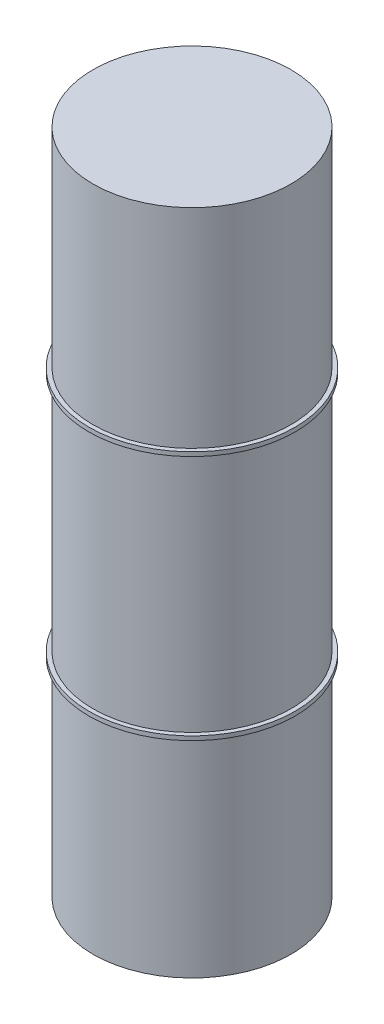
ISO-10303-21;
HEADER;
FILE_DESCRIPTION(('STEP AP214'),'2;1');
FILE_NAME('part.step','',(''),(''),'','','');
FILE_SCHEMA(('AUTOMOTIVE_DESIGN { 1 0 10303 214 1 1 1 1 }'));
ENDSEC;
DATA;
#1=APPLICATION_CONTEXT('core data for automotive mechanical design processes');
#2=APPLICATION_PROTOCOL_DEFINITION('international standard','automotive_design',2000,#1);
#3=PRODUCT_CONTEXT('',#1,'mechanical');
#4=PRODUCT('Part','Part','',(#3));
#5=PRODUCT_RELATED_PRODUCT_CATEGORY('part','',(#4));
#6=PRODUCT_DEFINITION_FORMATION('','',#4);
#7=PRODUCT_DEFINITION_CONTEXT('part definition',#1,'design');
#8=PRODUCT_DEFINITION('design','',#6,#7);
#9=PRODUCT_DEFINITION_SHAPE('','',#8);
#10=(LENGTH_UNIT() NAMED_UNIT(*) SI_UNIT(.MILLI.,.METRE.));
#11=(NAMED_UNIT(*) PLANE_ANGLE_UNIT() SI_UNIT($,.RADIAN.));
#12=(NAMED_UNIT(*) SI_UNIT($,.STERADIAN.) SOLID_ANGLE_UNIT());
#13=UNCERTAINTY_MEASURE_WITH_UNIT(LENGTH_MEASURE(1.E-05),#10,'distance_accuracy_value','');
#14=(GEOMETRIC_REPRESENTATION_CONTEXT(3) GLOBAL_UNCERTAINTY_ASSIGNED_CONTEXT((#13)) GLOBAL_UNIT_ASSIGNED_CONTEXT((#10,
#11,#12)) REPRESENTATION_CONTEXT('',''));
#15=CARTESIAN_POINT('',(0.,0.,0.));
#16=DIRECTION('',(0.,0.,1.));
#17=DIRECTION('',(1.,0.,0.));
#18=AXIS2_PLACEMENT_3D('',#15,#16,#17);
#19=CARTESIAN_POINT('',(0.,32.,0.));
#20=DIRECTION('',(0.,-1.,0.));
#21=DIRECTION('',(0.,0.,-1.));
#22=AXIS2_PLACEMENT_3D('',#19,#20,#21);
#23=CYLINDRICAL_SURFACE('',#22,4.75);
#24=CARTESIAN_POINT('',(0.,10.2,0.));
#25=DIRECTION('',(0.,1.,0.));
#26=DIRECTION('',(0.,0.,1.));
#27=AXIS2_PLACEMENT_3D('',#24,#25,#26);
#28=CIRCLE('',#27,4.75);
#29=CARTESIAN_POINT('',(0.,10.2,4.75));
#30=VERTEX_POINT('',#29);
#31=EDGE_CURVE('E50',#30,#30,#28,.T.);
#32=ORIENTED_EDGE('',*,*,#31,.T.);
#33=EDGE_LOOP('',(#32));
#34=FACE_BOUND('',#33,.T.);
#35=CARTESIAN_POINT('',(0.,21.8,0.));
#36=DIRECTION('',(0.,1.,0.));
#37=DIRECTION('',(0.,0.,1.));
#38=AXIS2_PLACEMENT_3D('',#35,#36,#37);
#39=CIRCLE('',#38,4.75);
#40=CARTESIAN_POINT('',(0.,21.8,4.75));
#41=VERTEX_POINT('',#40);
#42=EDGE_CURVE('E10',#41,#41,#39,.T.);
#43=ORIENTED_EDGE('',*,*,#42,.F.);
#44=EDGE_LOOP('',(#43));
#45=FACE_BOUND('',#44,.T.);
#46=ADVANCED_FACE('F30',(#34,#45),#23,.T.);
#47=CARTESIAN_POINT('',(0.,10.2,0.));
#48=DIRECTION('',(0.,1.,0.));
#49=DIRECTION('',(0.,0.,1.));
#50=AXIS2_PLACEMENT_3D('',#47,#48,#49);
#51=PLANE('',#50);
#52=CARTESIAN_POINT('',(0.,10.2,0.));
#53=DIRECTION('',(0.,1.,0.));
#54=DIRECTION('',(0.,0.,1.));
#55=AXIS2_PLACEMENT_3D('',#52,#53,#54);
#56=CIRCLE('',#55,4.95);
#57=CARTESIAN_POINT('',(0.,10.2,4.95));
#58=VERTEX_POINT('',#57);
#59=EDGE_CURVE('E52',#58,#58,#56,.T.);
#60=ORIENTED_EDGE('',*,*,#59,.T.);
#61=EDGE_LOOP('',(#60));
#62=FACE_BOUND('',#61,.T.);
#63=ORIENTED_EDGE('',*,*,#31,.F.);
#64=EDGE_LOOP('',(#63));
#65=FACE_BOUND('',#64,.T.);
#66=ADVANCED_FACE('F72',(#62,#65),#51,.T.);
#67=CARTESIAN_POINT('',(0.,10.,0.));
#68=DIRECTION('',(0.,1.,0.));
#69=DIRECTION('',(0.,0.,1.));
#70=AXIS2_PLACEMENT_3D('',#67,#68,#69);
#71=PLANE('',#70);
#72=CARTESIAN_POINT('',(0.,10.,0.));
#73=DIRECTION('',(0.,1.,0.));
#74=DIRECTION('',(0.,0.,1.));
#75=AXIS2_PLACEMENT_3D('',#72,#73,#74);
#76=CIRCLE('',#75,4.95);
#77=CARTESIAN_POINT('',(0.,10.,4.95));
#78=VERTEX_POINT('',#77);
#79=EDGE_CURVE('E55',#78,#78,#76,.T.);
#80=ORIENTED_EDGE('',*,*,#79,.F.);
#81=EDGE_LOOP('',(#80));
#82=FACE_BOUND('',#81,.T.);
#83=CARTESIAN_POINT('',(0.,10.,0.));
#84=DIRECTION('',(0.,1.,0.));
#85=DIRECTION('',(0.,0.,1.));
#86=AXIS2_PLACEMENT_3D('',#83,#84,#85);
#87=CIRCLE('',#86,4.75);
#88=CARTESIAN_POINT('',(0.,10.,4.75));
#89=VERTEX_POINT('',#88);
#90=EDGE_CURVE('E37',#89,#89,#87,.T.);
#91=ORIENTED_EDGE('',*,*,#90,.T.);
#92=EDGE_LOOP('',(#91));
#93=FACE_BOUND('',#92,.T.);
#94=ADVANCED_FACE('F79',(#82,#93),#71,.F.);
#95=CARTESIAN_POINT('',(0.,10.2,0.));
#96=DIRECTION('',(0.,-1.,0.));
#97=DIRECTION('',(0.,0.,-1.));
#98=AXIS2_PLACEMENT_3D('',#95,#96,#97);
#99=CYLINDRICAL_SURFACE('',#98,4.95);
#100=ORIENTED_EDGE('',*,*,#59,.F.);
#101=EDGE_LOOP('',(#100));
#102=FACE_BOUND('',#101,.T.);
#103=ORIENTED_EDGE('',*,*,#79,.T.);
#104=EDGE_LOOP('',(#103));
#105=FACE_BOUND('',#104,.T.);
#106=ADVANCED_FACE('F75',(#102,#105),#99,.T.);
#107=CARTESIAN_POINT('',(0.,0.,0.));
#108=DIRECTION('',(0.,1.,0.));
#109=DIRECTION('',(0.,0.,1.));
#110=AXIS2_PLACEMENT_3D('',#107,#108,#109);
#111=PLANE('',#110);
#112=CARTESIAN_POINT('',(0.,0.,0.));
#113=DIRECTION('',(0.,1.,0.));
#114=DIRECTION('',(0.,0.,1.));
#115=AXIS2_PLACEMENT_3D('',#112,#113,#114);
#116=CIRCLE('',#115,4.75);
#117=CARTESIAN_POINT('',(0.,0.,4.75));
#118=VERTEX_POINT('',#117);
#119=EDGE_CURVE('E46',#118,#118,#116,.T.);
#120=ORIENTED_EDGE('',*,*,#119,.F.);
#121=EDGE_LOOP('',(#120));
#122=FACE_BOUND('',#121,.T.);
#123=ADVANCED_FACE('F78',(#122),#111,.F.);
#124=ORIENTED_EDGE('',*,*,#119,.T.);
#125=EDGE_LOOP('',(#124));
#126=FACE_BOUND('',#125,.T.);
#127=ORIENTED_EDGE('',*,*,#90,.F.);
#128=EDGE_LOOP('',(#127));
#129=FACE_BOUND('',#128,.T.);
#130=ADVANCED_FACE('F91',(#126,#129),#23,.T.);
#131=CARTESIAN_POINT('',(0.,21.8,0.));
#132=DIRECTION('',(0.,1.,0.));
#133=DIRECTION('',(0.,0.,1.));
#134=AXIS2_PLACEMENT_3D('',#131,#132,#133);
#135=PLANE('',#134);
#136=CARTESIAN_POINT('',(0.,21.8,0.));
#137=DIRECTION('',(0.,1.,0.));
#138=DIRECTION('',(0.,0.,1.));
#139=AXIS2_PLACEMENT_3D('',#136,#137,#138);
#140=CIRCLE('',#139,4.95);
#141=CARTESIAN_POINT('',(0.,21.8,4.95));
#142=VERTEX_POINT('',#141);
#143=EDGE_CURVE('E56',#142,#142,#140,.T.);
#144=ORIENTED_EDGE('',*,*,#143,.F.);
#145=EDGE_LOOP('',(#144));
#146=FACE_BOUND('',#145,.T.);
#147=ORIENTED_EDGE('',*,*,#42,.T.);
#148=EDGE_LOOP('',(#147));
#149=FACE_BOUND('',#148,.T.);
#150=ADVANCED_FACE('F96',(#146,#149),#135,.F.);
#151=CARTESIAN_POINT('',(0.,22.,0.));
#152=DIRECTION('',(0.,1.,0.));
#153=DIRECTION('',(0.,0.,1.));
#154=AXIS2_PLACEMENT_3D('',#151,#152,#153);
#155=PLANE('',#154);
#156=CARTESIAN_POINT('',(0.,22.,0.));
#157=DIRECTION('',(0.,1.,0.));
#158=DIRECTION('',(0.,0.,1.));
#159=AXIS2_PLACEMENT_3D('',#156,#157,#158);
#160=CIRCLE('',#159,4.95);
#161=CARTESIAN_POINT('',(0.,22.,4.95));
#162=VERTEX_POINT('',#161);
#163=EDGE_CURVE('E62',#162,#162,#160,.T.);
#164=ORIENTED_EDGE('',*,*,#163,.T.);
#165=EDGE_LOOP('',(#164));
#166=FACE_BOUND('',#165,.T.);
#167=CARTESIAN_POINT('',(0.,22.,0.));
#168=DIRECTION('',(0.,1.,0.));
#169=DIRECTION('',(0.,0.,1.));
#170=AXIS2_PLACEMENT_3D('',#167,#168,#169);
#171=CIRCLE('',#170,4.75);
#172=CARTESIAN_POINT('',(0.,22.,4.75));
#173=VERTEX_POINT('',#172);
#174=EDGE_CURVE('E53',#173,#173,#171,.T.);
#175=ORIENTED_EDGE('',*,*,#174,.F.);
#176=EDGE_LOOP('',(#175));
#177=FACE_BOUND('',#176,.T.);
#178=ADVANCED_FACE('F111',(#166,#177),#155,.T.);
#179=CARTESIAN_POINT('',(0.,21.8,0.));
#180=DIRECTION('',(0.,1.,0.));
#181=DIRECTION('',(0.,0.,1.));
#182=AXIS2_PLACEMENT_3D('',#179,#180,#181);
#183=CYLINDRICAL_SURFACE('',#182,4.95);
#184=ORIENTED_EDGE('',*,*,#143,.T.);
#185=EDGE_LOOP('',(#184));
#186=FACE_BOUND('',#185,.T.);
#187=ORIENTED_EDGE('',*,*,#163,.F.);
#188=EDGE_LOOP('',(#187));
#189=FACE_BOUND('',#188,.T.);
#190=ADVANCED_FACE('F103',(#186,#189),#183,.T.);
#191=CARTESIAN_POINT('',(0.,32.,0.));
#192=DIRECTION('',(0.,1.,0.));
#193=DIRECTION('',(0.,0.,1.));
#194=AXIS2_PLACEMENT_3D('',#191,#192,#193);
#195=PLANE('',#194);
#196=CARTESIAN_POINT('',(0.,32.,0.));
#197=DIRECTION('',(0.,1.,0.));
#198=DIRECTION('',(0.,0.,1.));
#199=AXIS2_PLACEMENT_3D('',#196,#197,#198);
#200=CIRCLE('',#199,4.75);
#201=CARTESIAN_POINT('',(0.,32.,4.75));
#202=VERTEX_POINT('',#201);
#203=EDGE_CURVE('E41',#202,#202,#200,.T.);
#204=ORIENTED_EDGE('',*,*,#203,.T.);
#205=EDGE_LOOP('',(#204));
#206=FACE_BOUND('',#205,.T.);
#207=ADVANCED_FACE('F99',(#206),#195,.T.);
#208=ORIENTED_EDGE('',*,*,#174,.T.);
#209=EDGE_LOOP('',(#208));
#210=FACE_BOUND('',#209,.T.);
#211=ORIENTED_EDGE('',*,*,#203,.F.);
#212=EDGE_LOOP('',(#211));
#213=FACE_BOUND('',#212,.T.);
#214=ADVANCED_FACE('F32',(#210,#213),#23,.T.);
#215=CLOSED_SHELL('',(#46,#66,#94,#106,#123,#130,#150,#178,#190,#207,#214));
#216=MANIFOLD_SOLID_BREP('B2',#215);
#217=ADVANCED_BREP_SHAPE_REPRESENTATION('',(#18,#216),#14);
#218=SHAPE_DEFINITION_REPRESENTATION(#9,#217);
ENDSEC;
END-ISO-10303-21;
